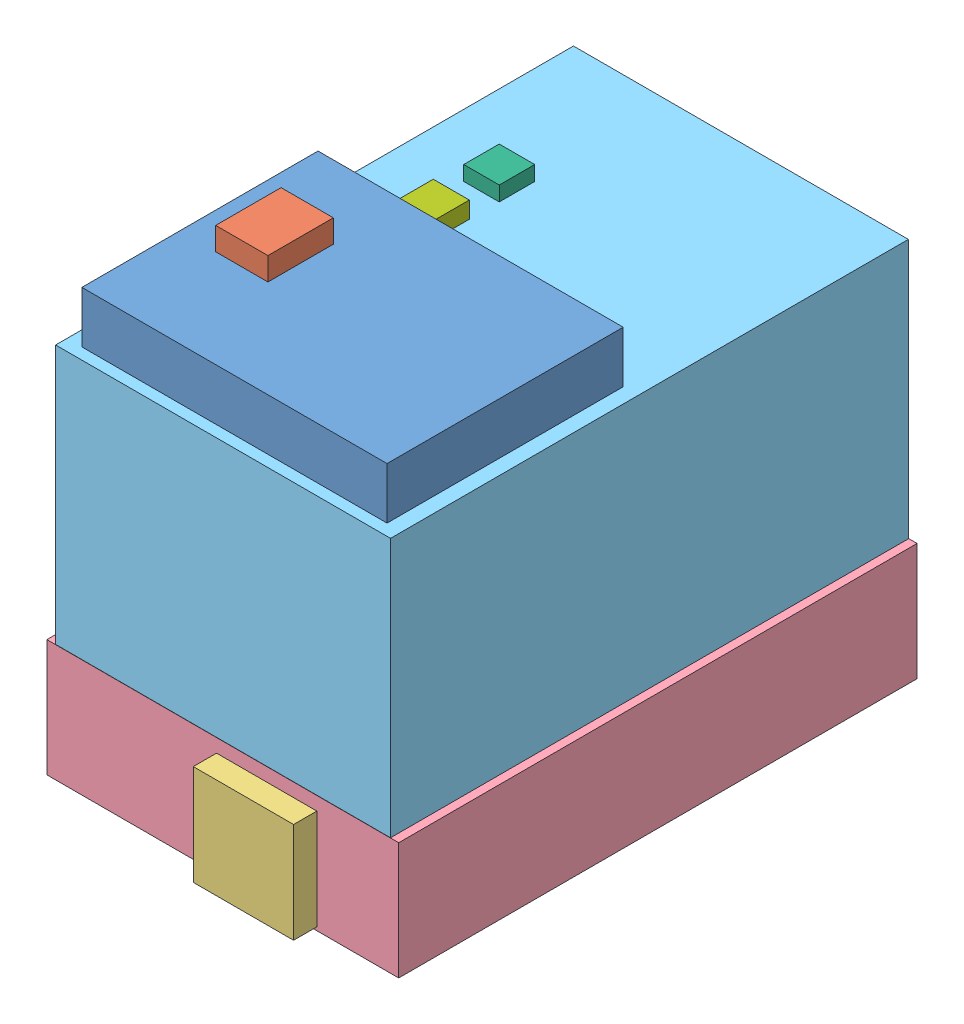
SolidWorks assembly T0249_demofile_bbox_final_4swx.sldasm, configuration Standard (file format 10000). Lengths in mm.
Overall size (210.5 269.78 324.08).
10 component instances, 7 part files, 0 mates.
Components (placement in the parent):
- sub1-1: sub1.sldasm [Standard] at origin size (210.5 269.78 324.08)
  - ( ) T0249a-Klappdeckel Geometry-1: ( ) T0249a-Klappdeckel Geometry.sldprt [Standard] at (0 32.17 0) size (182.59 40.71 141.31)
  - ( ) Knopf-1: ( ) Knopf.sldprt [Standard] at (0 39.03 0) size (31.28 28.38 39.14)
  - sub-sub2-1: sub-sub2.sldasm [Standard] at origin size (210.5 235.22 324.08)
    - T0249-Luefter-1: T0249-Luefter.sldprt [Standard] at origin size (60.01 60.01 32.46)
    - ( ) T0249-b base-1: ( ) T0249-b base.sldprt [Standard] at origin size (210.5 70.09 310.17)
    - sub-sub-sub3-1: sub-sub-sub3.sldasm [Standard] at origin size (200.4 165.22 309.83)
      - blk(000004)  ( ) T0249-c1-1: blk(000004)  ( ) T0249-c1.sldprt [Standard] at origin size (200.4 155.24 309.83)
      - blk(000005)  ( ) T0249-c2-1: blk(000005)  ( ) T0249-c2.sldprt [Standard] at origin size (21.25 11.79 21.23)
      - blk(000006)  ( ) T0249-c3-1: blk(000006)  ( ) T0249-c3.sldprt [Standard] at origin size (21.55 12.98 22.05)
